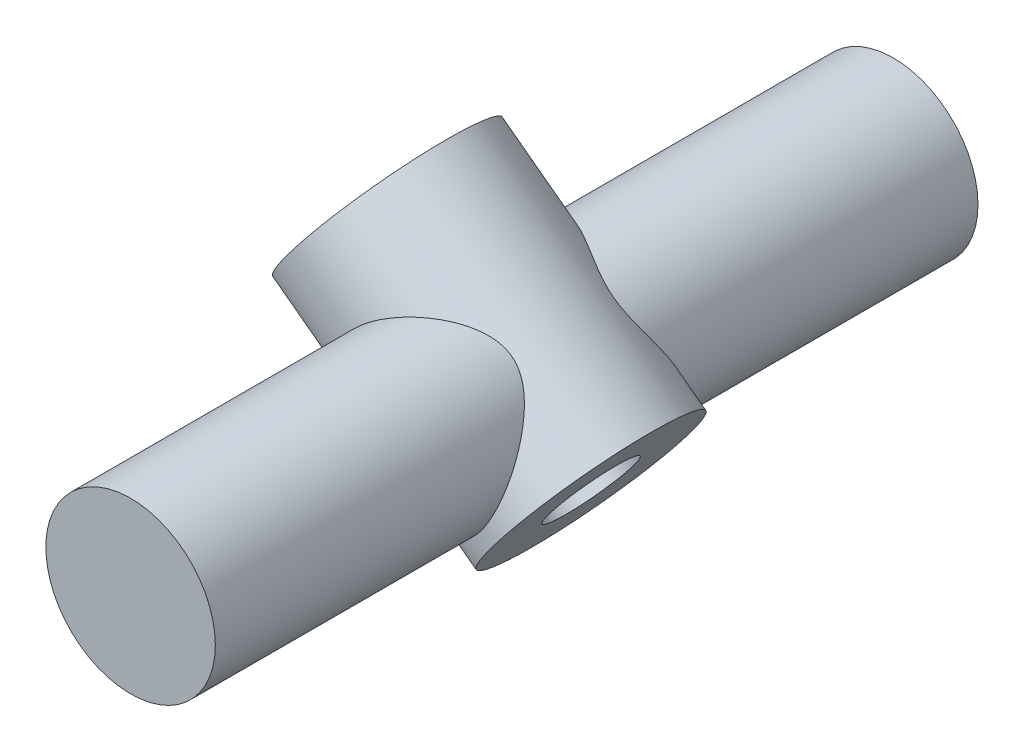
from build123d import *

# Parameters (mm, degrees)
PUENTE_PROFILE_R           = 6
BOSS_TORNILLO_PROFILE_R    = 7
TALADRO_TORNILLO_PROFILE_R = 3


with BuildPart() as part:
    # Puente: sweep along a curve in space
    with BuildLine() as puente_path:
        Line((-215.759160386, 344.756610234, -27), (-215.759160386, 344.756610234, 27))
    # Puente profile (on start of the path) → Puente (sweep)
    with BuildSketch(Plane(origin=(-215.759160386, 344.756610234, -27), x_dir=(1, 0, 0), z_dir=(0, 0, 1))):
        Circle(PUENTE_PROFILE_R)
    sweep(path=puente_path.line)

    # Boss_tornillo: sweep along a curve in space
    with BuildLine() as boss_tornillo_path:
        Line((-210.15458046, 340.562723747, 0), (-224.566357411, 351.347003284, 0))
    # Boss_tornillo profile (on start of the path) → Boss_tornillo (sweep)
    with BuildSketch(Plane(origin=(-210.15458046, 340.562723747, 0), x_dir=(-0.5991266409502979, -0.8006542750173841, 0), z_dir=(-0.8006542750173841, 0.5991266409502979, 0))):
        Circle(BOSS_TORNILLO_PROFILE_R)
    sweep(path=boss_tornillo_path.line)

    # Taladro_tornillo: sweep along a curve in space
    with BuildLine() as taladro_tornillo_path:
        Line((-209.353926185, 339.963597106, 0), (-225.367011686, 351.946129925, 0))
    # Taladro_tornillo profile (on start of the path) → Taladro_tornillo (sweep, cut)
    with BuildSketch(Plane(origin=(-209.353926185, 339.963597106, 0), x_dir=(-0.5991266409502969, -0.8006542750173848, 0), z_dir=(-0.8006542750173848, 0.5991266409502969, 0))):
        Circle(TALADRO_TORNILLO_PROFILE_R)
    sweep(path=taladro_tornillo_path.line, mode=Mode.SUBTRACT)


solid = part.part
